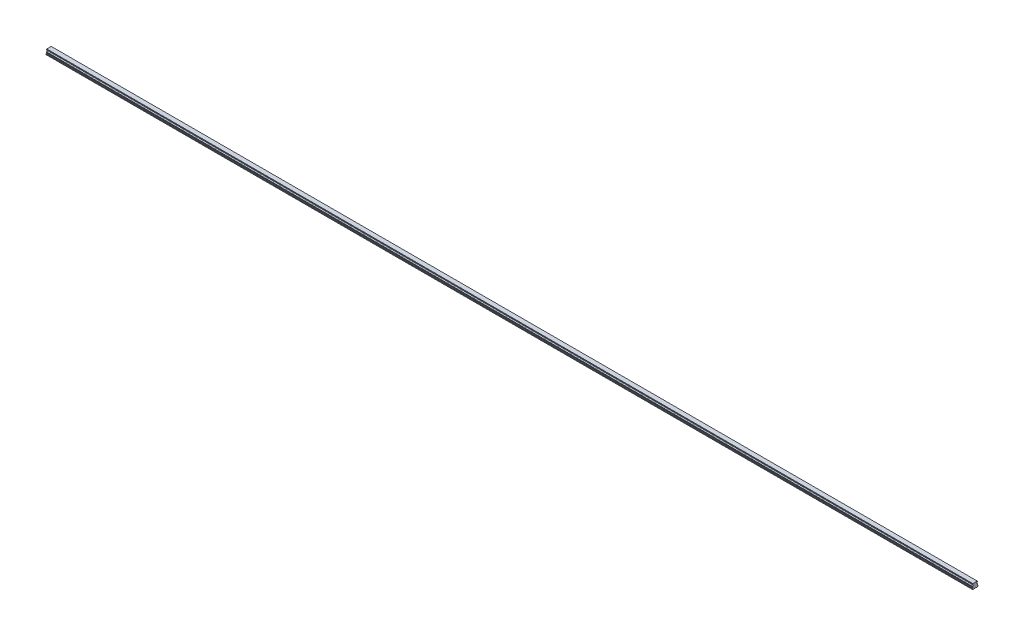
from build123d import *

# Parameters (mm, degrees)
BOSS_EXTRUDE1_DEPTH        = 3900
SKETCH3_R                  = 3
SKETCH3_R_2                = 2.5
CUT_EXTRUDE3_DEPTH         = 12
SKETCH3_2_R                = 2.5
CUT_EXTRUDE4_DEPTH         = 15
CHAMFER1_SIZE              = 0.5
LPATTERN4_COUNT            = 65
LPATTERN4_PITCH            = 60
CHAMFER1_OF_LPATTERN4_SIZE = 0.5


with BuildPart() as part:
    # Sketch1 → Boss-Extrude1 (new body)
    with BuildSketch(Plane(origin=(0, 0, 0), x_dir=(0, 0, -1), z_dir=(1, 0, 0))):
        with BuildLine():
            Line((9.375, 21.8), (-9.375, 21.8))
            Line((-9.375, 21.8), (-9.375, 20.756))
            Line((-9.375, 20.756), (-10, 19.415683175))
            Line((-10, 19.415683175), (-10, 17.685449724))
            ThreePointArc((-10, 17.685449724), (-7.2, 14.6), (-10, 11.514550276))
            Line((-10, 11.514550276), (-10, 9.784316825))
            Line((-10, 9.784316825), (-9.375, 8.444))
            Line((-9.375, 8.444), (-9.922688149, 6.4))
            Line((-9.922688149, 6.4), (-12.5, 5.489338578))
            Line((-12.5, 5.489338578), (-12.5, 2.65))
            Line((-12.5, 2.65), (-9.85, 0))
            Line((-9.85, 0), (-5.5, 0))
            Line((-5.5, 0), (-5, 0.5))
            Line((-5, 0.5), (5, 0.5))
            Line((5, 0.5), (5.5, 0))
            Line((5.5, 0), (9.85, 0))
            Line((9.85, 0), (12.5, 2.65))
            Line((12.5, 2.65), (12.5, 5.489338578))
            Line((12.5, 5.489338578), (9.922688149, 6.4))
            Line((9.922688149, 6.4), (9.375, 8.444))
            Line((9.375, 8.444), (10, 9.784316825))
            Line((10, 9.784316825), (10, 11.514550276))
            ThreePointArc((10, 11.514550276), (7.2, 14.6), (10, 17.685449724))
            Line((10, 17.685449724), (10, 19.415683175))
            Line((10, 19.415683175), (9.375, 20.756))
            Line((9.375, 20.756), (9.375, 21.8))
        make_face()
    extrude(amount=BOSS_EXTRUDE1_DEPTH)

    # Sketch3 → Cut-Extrude3 (cut)
    with BuildSketch(Plane.XZ):
        with Locations(Location((30, 0, 0), (0, 0, 270))):
            Circle(SKETCH3_R)
        with Locations(Location((30, 0, 0), (0, 0, 270))):
            Circle(SKETCH3_R_2, mode=Mode.SUBTRACT)
    cut_extrude3 = extrude(amount=-CUT_EXTRUDE3_DEPTH, mode=Mode.SUBTRACT)

    # Sketch3_2 → Cut-Extrude4 (cut)
    with BuildSketch(Plane.XZ):
        with Locations(Location((30, 0, 0), (0, 0, 270))):
            Circle(SKETCH3_2_R)
    cut_extrude4 = extrude(amount=-CUT_EXTRUDE4_DEPTH, mode=Mode.SUBTRACT)

    # Cut-Extrude5 cone 1 section (on through the dimple's axis) → Cut-Extrude5 (revolve, cut)
    with BuildSketch(Plane(origin=(30, 15, 0), x_dir=(0, 0, -1), z_dir=(1, 0, 0))):
        Polygon((0, 0), (2.5, 0), (0, 1.443375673), align=None)
    cut_extrude5 = revolve(axis=Axis((30, 15, 0), (0, 1, 0)), mode=Mode.SUBTRACT)

    # Chamfer1
    chamfer1_edges = [part.edges().sort_by_distance(p)[0] for p in [
        (30, 0.5, 3),
    ]]
    chamfer(chamfer1_edges, length=CHAMFER1_SIZE)

    # LPattern4: Cut-Extrude3, Cut-Extrude4, Cut-Extrude5 ×65
    with Locations(*[(i * LPATTERN4_PITCH, 0, 0) for i in range(1, LPATTERN4_COUNT)]):
        add(cut_extrude3, mode=Mode.SUBTRACT)
        add(cut_extrude4, mode=Mode.SUBTRACT)
        add(cut_extrude5, mode=Mode.SUBTRACT)

    # Chamfer1 of LPattern4
    chamfer1_of_lpattern4_edges = [part.edges().sort_by_distance(p)[0] for p in [
        (90, 0.5, 3),
        (150, 0.5, 3),
        (210, 0.5, 3),
        (270, 0.5, 3),
        (330, 0.5, 3),
        (390, 0.5, 3),
        (450, 0.5, 3),
        (510, 0.5, 3),
        (570, 0.5, 3),
        (630, 0.5, 3),
        (690, 0.5, 3),
        (750, 0.5, 3),
        (810, 0.5, 3),
        (870, 0.5, 3),
        (930, 0.5, 3),
        (990, 0.5, 3),
        (1050, 0.5, 3),
        (1110, 0.5, 3),
        (1170, 0.5, 3),
        (1230, 0.5, 3),
        (1290, 0.5, 3),
        (1350, 0.5, 3),
        (1410, 0.5, 3),
        (1470, 0.5, 3),
        (1530, 0.5, 3),
        (1590, 0.5, 3),
        (1650, 0.5, 3),
        (1710, 0.5, 3),
        (1770, 0.5, 3),
        (1830, 0.5, 3),
        (1890, 0.5, 3),
        (1950, 0.5, 3),
        (2010, 0.5, 3),
        (2070, 0.5, 3),
        (2130, 0.5, 3),
        (2190, 0.5, 3),
        (2250, 0.5, 3),
        (2310, 0.5, 3),
        (2370, 0.5, 3),
        (2430, 0.5, 3),
        (2490, 0.5, 3),
        (2550, 0.5, 3),
        (2610, 0.5, 3),
        (2670, 0.5, 3),
        (2730, 0.5, 3),
        (2790, 0.5, 3),
        (2850, 0.5, 3),
        (2910, 0.5, 3),
        (2970, 0.5, 3),
        (3030, 0.5, 3),
        (3090, 0.5, 3),
        (3150, 0.5, 3),
        (3210, 0.5, 3),
        (3270, 0.5, 3),
        (3330, 0.5, 3),
        (3390, 0.5, 3),
        (3450, 0.5, 3),
        (3510, 0.5, 3),
        (3570, 0.5, 3),
        (3630, 0.5, 3),
        (3690, 0.5, 3),
        (3750, 0.5, 3),
        (3810, 0.5, 3),
        (3870, 0.5, 3),
    ]]
    chamfer(chamfer1_of_lpattern4_edges, length=CHAMFER1_OF_LPATTERN4_SIZE)


solid = part.part
